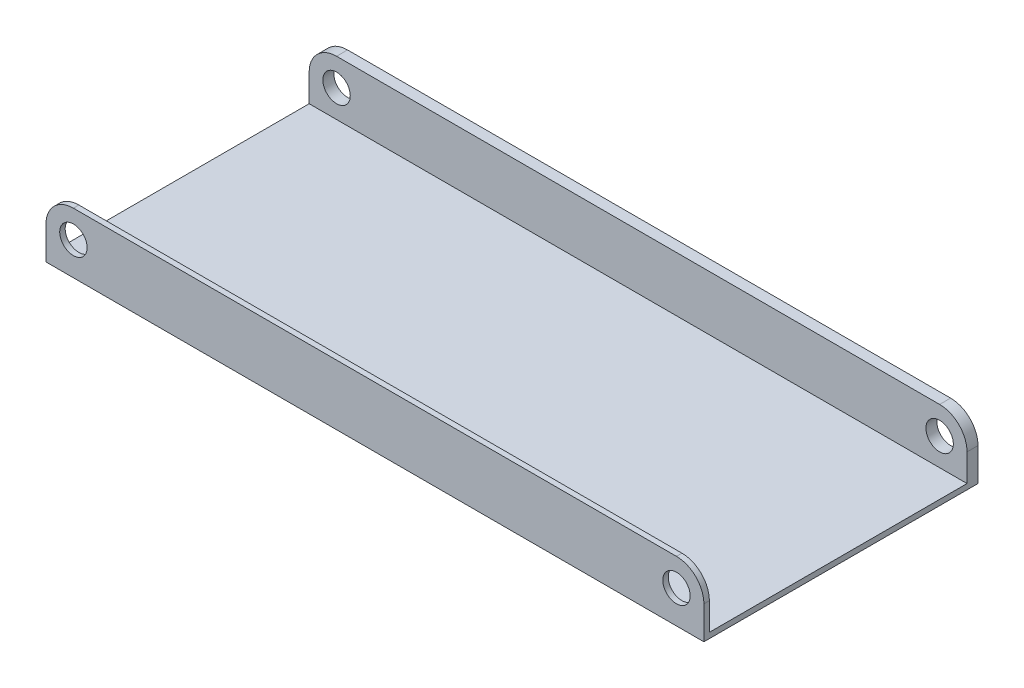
from build123d import *

# Parameters (mm, degrees)
SKETCH1_W           = 152.4
SKETCH1_H           = 63.5
BOSS_EXTRUDE1_DEPTH = 1.27
SKETCH2_W           = 152.4
SKETCH2_H           = 1.27
SKETCH2_H_2         = 2.54
BOSS_EXTRUDE2_DEPTH = 12.7
SKETCH3_R           = 3.175
CUT_EXTRUDE1_DEPTH  = 166.689984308
FILLET1_R           = 6.35


with BuildPart() as part:
    # Sketch1 → Boss-Extrude1 (new body)
    with BuildSketch(Plane(origin=(0, 0, 0), x_dir=(1, 0, 0), z_dir=(0, 1, 0))):
        with Locations((76.2, -31.75)):
            Rectangle(SKETCH1_W, SKETCH1_H)
    extrude(amount=BOSS_EXTRUDE1_DEPTH)

    # Sketch2 → Boss-Extrude2 (add)
    with BuildSketch(Plane(origin=(0, 1.27, 0), x_dir=(1, 0, 0), z_dir=(0, 1, 0))):
        with Locations((76.2, -62.865)):
            Rectangle(SKETCH2_W, SKETCH2_H)
        with Locations((76.2, -1.27)):
            Rectangle(SKETCH2_W, SKETCH2_H_2)
    extrude(amount=BOSS_EXTRUDE2_DEPTH)

    # Sketch3 → Cut-Extrude1 (cut, through all)
    with BuildSketch(Plane.XY.offset(63.5)):
        with Locations((6.35, 7.62)):
            Circle(SKETCH3_R)
        with Locations((146.05, 7.62)):
            Circle(SKETCH3_R)
    extrude(amount=-CUT_EXTRUDE1_DEPTH, mode=Mode.SUBTRACT)

    # Fillet1
    fillet1_edges = [part.edges().sort_by_distance(p)[0] for p in [
        (0, 13.97, 62.865),
        (152.4, 13.97, 62.865),
        (0, 13.97, 1.27),
        (152.4, 13.97, 1.27),
    ]]
    fillet(fillet1_edges, radius=FILLET1_R)


solid = part.part
